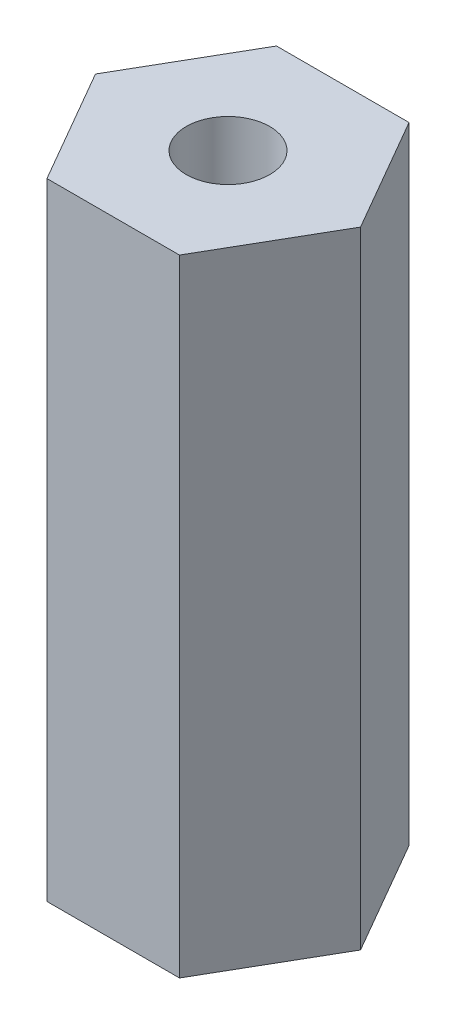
ISO-10303-21;
HEADER;
FILE_DESCRIPTION(('STEP AP214'),'2;1');
FILE_NAME('part.step','',(''),(''),'','','');
FILE_SCHEMA(('AUTOMOTIVE_DESIGN { 1 0 10303 214 1 1 1 1 }'));
ENDSEC;
DATA;
#1=APPLICATION_CONTEXT('core data for automotive mechanical design processes');
#2=APPLICATION_PROTOCOL_DEFINITION('international standard','automotive_design',2000,#1);
#3=PRODUCT_CONTEXT('',#1,'mechanical');
#4=PRODUCT('Part','Part','',(#3));
#5=PRODUCT_RELATED_PRODUCT_CATEGORY('part','',(#4));
#6=PRODUCT_DEFINITION_FORMATION('','',#4);
#7=PRODUCT_DEFINITION_CONTEXT('part definition',#1,'design');
#8=PRODUCT_DEFINITION('design','',#6,#7);
#9=PRODUCT_DEFINITION_SHAPE('','',#8);
#10=(LENGTH_UNIT() NAMED_UNIT(*) SI_UNIT(.MILLI.,.METRE.));
#11=(NAMED_UNIT(*) PLANE_ANGLE_UNIT() SI_UNIT($,.RADIAN.));
#12=(NAMED_UNIT(*) SI_UNIT($,.STERADIAN.) SOLID_ANGLE_UNIT());
#13=UNCERTAINTY_MEASURE_WITH_UNIT(LENGTH_MEASURE(1.E-05),#10,'distance_accuracy_value','');
#14=(GEOMETRIC_REPRESENTATION_CONTEXT(3) GLOBAL_UNCERTAINTY_ASSIGNED_CONTEXT((#13)) GLOBAL_UNIT_ASSIGNED_CONTEXT((#10,
#11,#12)) REPRESENTATION_CONTEXT('',''));
#15=CARTESIAN_POINT('',(0.,0.,0.));
#16=DIRECTION('',(0.,0.,1.));
#17=DIRECTION('',(1.,0.,0.));
#18=AXIS2_PLACEMENT_3D('',#15,#16,#17);
#19=CARTESIAN_POINT('',(3.17542648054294,15.,0.));
#20=DIRECTION('',(-0.866025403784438,0.,0.5));
#21=DIRECTION('',(0.5,0.,0.866025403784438));
#22=AXIS2_PLACEMENT_3D('',#19,#20,#21);
#23=PLANE('',#22);
#24=DIRECTION('',(-0.5,0.,-0.866025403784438));
#25=VECTOR('',#24,1.);
#26=CARTESIAN_POINT('',(3.17542648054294,0.,0.));
#27=LINE('',#26,#25);
#28=CARTESIAN_POINT('',(3.17542648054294,0.,0.));
#29=VERTEX_POINT('',#28);
#30=CARTESIAN_POINT('',(1.58771324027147,0.,-2.75));
#31=VERTEX_POINT('',#30);
#32=EDGE_CURVE('E120',#29,#31,#27,.T.);
#33=ORIENTED_EDGE('',*,*,#32,.T.);
#34=DIRECTION('',(0.,-1.,0.));
#35=VECTOR('',#34,1.);
#36=CARTESIAN_POINT('',(1.58771324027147,15.,-2.75));
#37=LINE('',#36,#35);
#38=CARTESIAN_POINT('',(1.58771324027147,15.,-2.75));
#39=VERTEX_POINT('',#38);
#40=EDGE_CURVE('E11',#39,#31,#37,.T.);
#41=ORIENTED_EDGE('',*,*,#40,.F.);
#42=DIRECTION('',(-0.5,0.,-0.866025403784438));
#43=VECTOR('',#42,1.);
#44=CARTESIAN_POINT('',(3.17542648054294,15.,0.));
#45=LINE('',#44,#43);
#46=CARTESIAN_POINT('',(3.17542648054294,15.,0.));
#47=VERTEX_POINT('',#46);
#48=EDGE_CURVE('E131',#47,#39,#45,.T.);
#49=ORIENTED_EDGE('',*,*,#48,.F.);
#50=DIRECTION('',(0.,-1.,0.));
#51=VECTOR('',#50,1.);
#52=CARTESIAN_POINT('',(3.17542648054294,15.,0.));
#53=LINE('',#52,#51);
#54=EDGE_CURVE('E116',#47,#29,#53,.T.);
#55=ORIENTED_EDGE('',*,*,#54,.T.);
#56=EDGE_LOOP('',(#33,#41,#49,#55));
#57=FACE_BOUND('',#56,.T.);
#58=ADVANCED_FACE('F36',(#57),#23,.F.);
#59=CARTESIAN_POINT('',(1.58771324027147,15.,-2.75));
#60=DIRECTION('',(0.,0.,1.));
#61=DIRECTION('',(1.,0.,0.));
#62=AXIS2_PLACEMENT_3D('',#59,#60,#61);
#63=PLANE('',#62);
#64=DIRECTION('',(-1.,0.,0.));
#65=VECTOR('',#64,1.);
#66=CARTESIAN_POINT('',(1.58771324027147,0.,-2.75));
#67=LINE('',#66,#65);
#68=CARTESIAN_POINT('',(-1.58771324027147,0.,-2.75));
#69=VERTEX_POINT('',#68);
#70=EDGE_CURVE('E123',#31,#69,#67,.T.);
#71=ORIENTED_EDGE('',*,*,#70,.T.);
#72=DIRECTION('',(0.,-1.,0.));
#73=VECTOR('',#72,1.);
#74=CARTESIAN_POINT('',(-1.58771324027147,15.,-2.75));
#75=LINE('',#74,#73);
#76=CARTESIAN_POINT('',(-1.58771324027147,15.,-2.75));
#77=VERTEX_POINT('',#76);
#78=EDGE_CURVE('E44',#77,#69,#75,.T.);
#79=ORIENTED_EDGE('',*,*,#78,.F.);
#80=DIRECTION('',(-1.,0.,0.));
#81=VECTOR('',#80,1.);
#82=CARTESIAN_POINT('',(1.58771324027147,15.,-2.75));
#83=LINE('',#82,#81);
#84=EDGE_CURVE('E89',#39,#77,#83,.T.);
#85=ORIENTED_EDGE('',*,*,#84,.F.);
#86=ORIENTED_EDGE('',*,*,#40,.T.);
#87=EDGE_LOOP('',(#71,#79,#85,#86));
#88=FACE_BOUND('',#87,.T.);
#89=ADVANCED_FACE('F156',(#88),#63,.F.);
#90=CARTESIAN_POINT('',(-1.58771324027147,15.,-2.75));
#91=DIRECTION('',(0.866025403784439,0.,0.499999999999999));
#92=DIRECTION('',(0.5,0.,-0.866025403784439));
#93=AXIS2_PLACEMENT_3D('',#90,#91,#92);
#94=PLANE('',#93);
#95=DIRECTION('',(-0.499999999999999,0.,0.866025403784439));
#96=VECTOR('',#95,1.);
#97=CARTESIAN_POINT('',(-1.58771324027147,0.,-2.75));
#98=LINE('',#97,#96);
#99=CARTESIAN_POINT('',(-3.17542648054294,0.,0.));
#100=VERTEX_POINT('',#99);
#101=EDGE_CURVE('E126',#69,#100,#98,.T.);
#102=ORIENTED_EDGE('',*,*,#101,.T.);
#103=DIRECTION('',(0.,-1.,0.));
#104=VECTOR('',#103,1.);
#105=CARTESIAN_POINT('',(-3.17542648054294,15.,0.));
#106=LINE('',#105,#104);
#107=CARTESIAN_POINT('',(-3.17542648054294,15.,0.));
#108=VERTEX_POINT('',#107);
#109=EDGE_CURVE('E111',#108,#100,#106,.T.);
#110=ORIENTED_EDGE('',*,*,#109,.F.);
#111=DIRECTION('',(-0.499999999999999,0.,0.866025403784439));
#112=VECTOR('',#111,1.);
#113=CARTESIAN_POINT('',(-1.58771324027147,15.,-2.75));
#114=LINE('',#113,#112);
#115=EDGE_CURVE('E102',#77,#108,#114,.T.);
#116=ORIENTED_EDGE('',*,*,#115,.F.);
#117=ORIENTED_EDGE('',*,*,#78,.T.);
#118=EDGE_LOOP('',(#102,#110,#116,#117));
#119=FACE_BOUND('',#118,.T.);
#120=ADVANCED_FACE('F137',(#119),#94,.F.);
#121=CARTESIAN_POINT('',(-3.17542648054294,15.,0.));
#122=DIRECTION('',(0.866025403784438,0.,-0.5));
#123=DIRECTION('',(-0.5,0.,-0.866025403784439));
#124=AXIS2_PLACEMENT_3D('',#121,#122,#123);
#125=PLANE('',#124);
#126=DIRECTION('',(0.5,0.,0.866025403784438));
#127=VECTOR('',#126,1.);
#128=CARTESIAN_POINT('',(-3.17542648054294,0.,0.));
#129=LINE('',#128,#127);
#130=CARTESIAN_POINT('',(-1.58771324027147,0.,2.75));
#131=VERTEX_POINT('',#130);
#132=EDGE_CURVE('E110',#100,#131,#129,.T.);
#133=ORIENTED_EDGE('',*,*,#132,.T.);
#134=DIRECTION('',(0.,-1.,0.));
#135=VECTOR('',#134,1.);
#136=CARTESIAN_POINT('',(-1.58771324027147,15.,2.75));
#137=LINE('',#136,#135);
#138=CARTESIAN_POINT('',(-1.58771324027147,15.,2.75));
#139=VERTEX_POINT('',#138);
#140=EDGE_CURVE('E107',#139,#131,#137,.T.);
#141=ORIENTED_EDGE('',*,*,#140,.F.);
#142=DIRECTION('',(0.5,0.,0.866025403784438));
#143=VECTOR('',#142,1.);
#144=CARTESIAN_POINT('',(-3.17542648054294,15.,0.));
#145=LINE('',#144,#143);
#146=EDGE_CURVE('E96',#108,#139,#145,.T.);
#147=ORIENTED_EDGE('',*,*,#146,.F.);
#148=ORIENTED_EDGE('',*,*,#109,.T.);
#149=EDGE_LOOP('',(#133,#141,#147,#148));
#150=FACE_BOUND('',#149,.T.);
#151=ADVANCED_FACE('F108',(#150),#125,.F.);
#152=CARTESIAN_POINT('',(-1.58771324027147,15.,2.75));
#153=DIRECTION('',(0.,0.,-1.));
#154=DIRECTION('',(-1.,0.,0.));
#155=AXIS2_PLACEMENT_3D('',#152,#153,#154);
#156=PLANE('',#155);
#157=DIRECTION('',(1.,0.,0.));
#158=VECTOR('',#157,1.);
#159=CARTESIAN_POINT('',(-1.58771324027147,0.,2.75));
#160=LINE('',#159,#158);
#161=CARTESIAN_POINT('',(1.58771324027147,0.,2.75));
#162=VERTEX_POINT('',#161);
#163=EDGE_CURVE('E75',#131,#162,#160,.T.);
#164=ORIENTED_EDGE('',*,*,#163,.T.);
#165=DIRECTION('',(0.,-1.,0.));
#166=VECTOR('',#165,1.);
#167=CARTESIAN_POINT('',(1.58771324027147,15.,2.75));
#168=LINE('',#167,#166);
#169=CARTESIAN_POINT('',(1.58771324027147,15.,2.75));
#170=VERTEX_POINT('',#169);
#171=EDGE_CURVE('E112',#170,#162,#168,.T.);
#172=ORIENTED_EDGE('',*,*,#171,.F.);
#173=DIRECTION('',(1.,0.,0.));
#174=VECTOR('',#173,1.);
#175=CARTESIAN_POINT('',(-1.58771324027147,15.,2.75));
#176=LINE('',#175,#174);
#177=EDGE_CURVE('E100',#139,#170,#176,.T.);
#178=ORIENTED_EDGE('',*,*,#177,.F.);
#179=ORIENTED_EDGE('',*,*,#140,.T.);
#180=EDGE_LOOP('',(#164,#172,#178,#179));
#181=FACE_BOUND('',#180,.T.);
#182=ADVANCED_FACE('F114',(#181),#156,.F.);
#183=CARTESIAN_POINT('',(1.58771324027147,15.,2.75));
#184=DIRECTION('',(-0.866025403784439,0.,-0.5));
#185=DIRECTION('',(-0.5,0.,0.866025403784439));
#186=AXIS2_PLACEMENT_3D('',#183,#184,#185);
#187=PLANE('',#186);
#188=DIRECTION('',(0.5,0.,-0.866025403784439));
#189=VECTOR('',#188,1.);
#190=CARTESIAN_POINT('',(1.58771324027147,0.,2.75));
#191=LINE('',#190,#189);
#192=EDGE_CURVE('E81',#162,#29,#191,.T.);
#193=ORIENTED_EDGE('',*,*,#192,.T.);
#194=ORIENTED_EDGE('',*,*,#54,.F.);
#195=DIRECTION('',(0.5,0.,-0.866025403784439));
#196=VECTOR('',#195,1.);
#197=CARTESIAN_POINT('',(1.58771324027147,15.,2.75));
#198=LINE('',#197,#196);
#199=EDGE_CURVE('E52',#170,#47,#198,.T.);
#200=ORIENTED_EDGE('',*,*,#199,.F.);
#201=ORIENTED_EDGE('',*,*,#171,.T.);
#202=EDGE_LOOP('',(#193,#194,#200,#201));
#203=FACE_BOUND('',#202,.T.);
#204=ADVANCED_FACE('F144',(#203),#187,.F.);
#205=CARTESIAN_POINT('',(0.,15.,0.));
#206=DIRECTION('',(0.,1.,0.));
#207=DIRECTION('',(0.,0.,1.));
#208=AXIS2_PLACEMENT_3D('',#205,#206,#207);
#209=PLANE('',#208);
#210=CARTESIAN_POINT('',(0.,15.,0.));
#211=DIRECTION('',(0.,1.,0.));
#212=DIRECTION('',(0.,0.,1.));
#213=AXIS2_PLACEMENT_3D('',#210,#211,#212);
#214=CIRCLE('',#213,1.);
#215=CARTESIAN_POINT('',(0.,15.,1.));
#216=VERTEX_POINT('',#215);
#217=EDGE_CURVE('E213',#216,#216,#214,.T.);
#218=ORIENTED_EDGE('',*,*,#217,.F.);
#219=EDGE_LOOP('',(#218));
#220=FACE_BOUND('',#219,.T.);
#221=ORIENTED_EDGE('',*,*,#48,.T.);
#222=ORIENTED_EDGE('',*,*,#84,.T.);
#223=ORIENTED_EDGE('',*,*,#115,.T.);
#224=ORIENTED_EDGE('',*,*,#146,.T.);
#225=ORIENTED_EDGE('',*,*,#177,.T.);
#226=ORIENTED_EDGE('',*,*,#199,.T.);
#227=EDGE_LOOP('',(#221,#222,#223,#224,#225,#226));
#228=FACE_BOUND('',#227,.T.);
#229=ADVANCED_FACE('F98',(#220,#228),#209,.T.);
#230=CARTESIAN_POINT('',(0.,0.,0.));
#231=DIRECTION('',(0.,1.,0.));
#232=DIRECTION('',(0.,0.,1.));
#233=AXIS2_PLACEMENT_3D('',#230,#231,#232);
#234=PLANE('',#233);
#235=CARTESIAN_POINT('',(0.,0.,0.));
#236=DIRECTION('',(0.,1.,0.));
#237=DIRECTION('',(0.,0.,1.));
#238=AXIS2_PLACEMENT_3D('',#235,#236,#237);
#239=CIRCLE('',#238,1.);
#240=CARTESIAN_POINT('',(0.,0.,1.));
#241=VERTEX_POINT('',#240);
#242=EDGE_CURVE('E124',#241,#241,#239,.T.);
#243=ORIENTED_EDGE('',*,*,#242,.T.);
#244=EDGE_LOOP('',(#243));
#245=FACE_BOUND('',#244,.T.);
#246=ORIENTED_EDGE('',*,*,#32,.F.);
#247=ORIENTED_EDGE('',*,*,#192,.F.);
#248=ORIENTED_EDGE('',*,*,#163,.F.);
#249=ORIENTED_EDGE('',*,*,#132,.F.);
#250=ORIENTED_EDGE('',*,*,#101,.F.);
#251=ORIENTED_EDGE('',*,*,#70,.F.);
#252=EDGE_LOOP('',(#246,#247,#248,#249,#250,#251));
#253=FACE_BOUND('',#252,.T.);
#254=ADVANCED_FACE('F140',(#245,#253),#234,.F.);
#255=CARTESIAN_POINT('',(0.,0.,0.));
#256=DIRECTION('',(0.,1.,0.));
#257=DIRECTION('',(0.,0.,1.));
#258=AXIS2_PLACEMENT_3D('',#255,#256,#257);
#259=CYLINDRICAL_SURFACE('',#258,1.);
#260=ORIENTED_EDGE('',*,*,#242,.F.);
#261=EDGE_LOOP('',(#260));
#262=FACE_BOUND('',#261,.T.);
#263=ORIENTED_EDGE('',*,*,#217,.T.);
#264=EDGE_LOOP('',(#263));
#265=FACE_BOUND('',#264,.T.);
#266=ADVANCED_FACE('F193',(#262,#265),#259,.F.);
#267=CLOSED_SHELL('',(#58,#89,#120,#151,#182,#204,#229,#254,#266));
#268=MANIFOLD_SOLID_BREP('B2',#267);
#269=ADVANCED_BREP_SHAPE_REPRESENTATION('',(#18,#268),#14);
#270=SHAPE_DEFINITION_REPRESENTATION(#9,#269);
ENDSEC;
END-ISO-10303-21;
